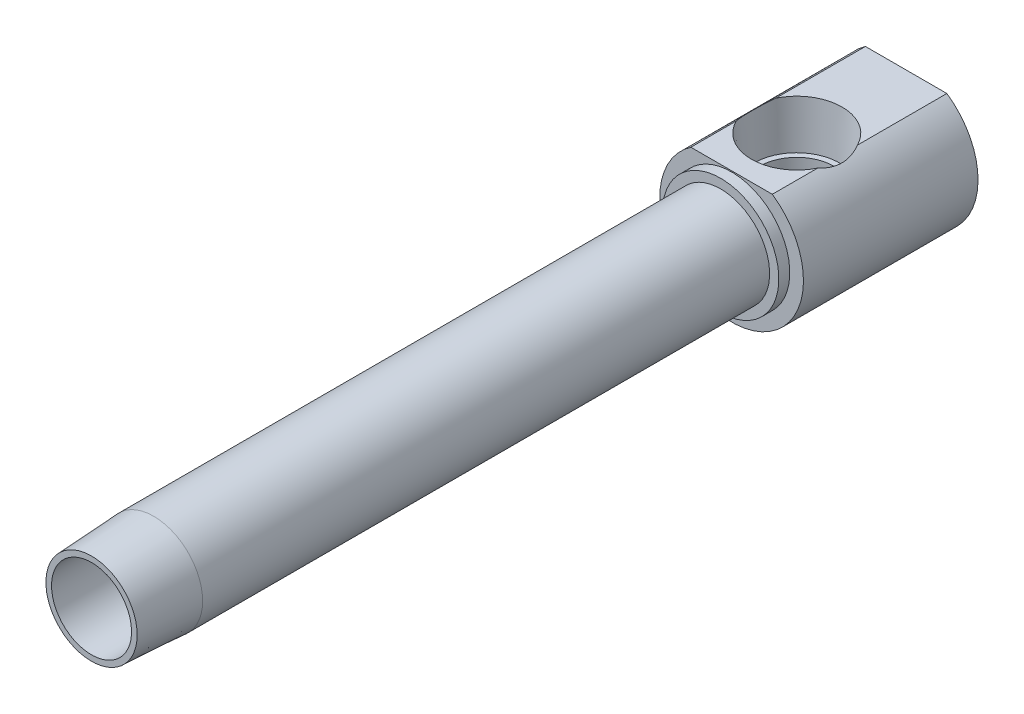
ISO-10303-21;
HEADER;
FILE_DESCRIPTION(('STEP AP214'),'2;1');
FILE_NAME('part.step','',(''),(''),'','','');
FILE_SCHEMA(('AUTOMOTIVE_DESIGN { 1 0 10303 214 1 1 1 1 }'));
ENDSEC;
DATA;
#1=APPLICATION_CONTEXT('core data for automotive mechanical design processes');
#2=APPLICATION_PROTOCOL_DEFINITION('international standard','automotive_design',2000,#1);
#3=PRODUCT_CONTEXT('',#1,'mechanical');
#4=PRODUCT('Part','Part','',(#3));
#5=PRODUCT_RELATED_PRODUCT_CATEGORY('part','',(#4));
#6=PRODUCT_DEFINITION_FORMATION('','',#4);
#7=PRODUCT_DEFINITION_CONTEXT('part definition',#1,'design');
#8=PRODUCT_DEFINITION('design','',#6,#7);
#9=PRODUCT_DEFINITION_SHAPE('','',#8);
#10=(LENGTH_UNIT() NAMED_UNIT(*) SI_UNIT(.MILLI.,.METRE.));
#11=(NAMED_UNIT(*) PLANE_ANGLE_UNIT() SI_UNIT($,.RADIAN.));
#12=(NAMED_UNIT(*) SI_UNIT($,.STERADIAN.) SOLID_ANGLE_UNIT());
#13=UNCERTAINTY_MEASURE_WITH_UNIT(LENGTH_MEASURE(1.E-05),#10,'distance_accuracy_value','');
#14=(GEOMETRIC_REPRESENTATION_CONTEXT(3) GLOBAL_UNCERTAINTY_ASSIGNED_CONTEXT((#13)) GLOBAL_UNIT_ASSIGNED_CONTEXT((#10,
#11,#12)) REPRESENTATION_CONTEXT('',''));
#15=CARTESIAN_POINT('',(0.,0.,0.));
#16=DIRECTION('',(0.,0.,1.));
#17=DIRECTION('',(1.,0.,0.));
#18=AXIS2_PLACEMENT_3D('',#15,#16,#17);
#19=CARTESIAN_POINT('',(0.,0.,-195.847166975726));
#20=DIRECTION('',(0.,0.,-1.));
#21=DIRECTION('',(-1.,0.,0.));
#22=AXIS2_PLACEMENT_3D('',#19,#20,#21);
#23=CYLINDRICAL_SURFACE('',#22,10.6883167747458);
#24=CARTESIAN_POINT('',(0.,0.,-137.3124));
#25=DIRECTION('',(0.,0.,-1.));
#26=DIRECTION('',(-1.,0.,0.));
#27=AXIS2_PLACEMENT_3D('',#24,#25,#26);
#28=CIRCLE('',#27,10.6883167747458);
#29=CARTESIAN_POINT('',(-10.6883167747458,0.,-137.3124));
#30=VERTEX_POINT('',#29);
#31=EDGE_CURVE('E143',#30,#30,#28,.T.);
#32=ORIENTED_EDGE('',*,*,#31,.F.);
#33=EDGE_LOOP('',(#32));
#34=FACE_BOUND('',#33,.T.);
#35=CARTESIAN_POINT('',(0.,0.,-13.5636));
#36=DIRECTION('',(0.,0.,1.));
#37=DIRECTION('',(1.,0.,0.));
#38=AXIS2_PLACEMENT_3D('',#35,#36,#37);
#39=CIRCLE('',#38,10.6883167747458);
#40=CARTESIAN_POINT('',(10.6883167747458,0.,-13.5636));
#41=VERTEX_POINT('',#40);
#42=EDGE_CURVE('E229',#41,#41,#39,.T.);
#43=ORIENTED_EDGE('',*,*,#42,.F.);
#44=EDGE_LOOP('',(#43));
#45=FACE_BOUND('',#44,.T.);
#46=ADVANCED_FACE('F15',(#34,#45),#23,.T.);
#47=CARTESIAN_POINT('',(-8.73125000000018,0.,0.));
#48=DIRECTION('',(0.,0.,1.));
#49=DIRECTION('',(1.,0.,0.));
#50=AXIS2_PLACEMENT_3D('',#47,#48,#49);
#51=PLANE('',#50);
#52=CARTESIAN_POINT('',(0.,0.,0.));
#53=DIRECTION('',(0.,0.,-1.));
#54=DIRECTION('',(-1.,0.,0.));
#55=AXIS2_PLACEMENT_3D('',#52,#53,#54);
#56=CIRCLE('',#55,8.73125000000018);
#57=CARTESIAN_POINT('',(-8.73125000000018,0.,0.));
#58=VERTEX_POINT('',#57);
#59=EDGE_CURVE('E19',#58,#58,#56,.T.);
#60=ORIENTED_EDGE('',*,*,#59,.T.);
#61=EDGE_LOOP('',(#60));
#62=FACE_BOUND('',#61,.T.);
#63=CARTESIAN_POINT('',(0.,0.,0.));
#64=DIRECTION('',(0.,0.,1.));
#65=DIRECTION('',(1.,0.,0.));
#66=AXIS2_PLACEMENT_3D('',#63,#64,#65);
#67=CIRCLE('',#66,9.9568);
#68=CARTESIAN_POINT('',(9.9568,0.,0.));
#69=VERTEX_POINT('',#68);
#70=EDGE_CURVE('E231',#69,#69,#67,.T.);
#71=ORIENTED_EDGE('',*,*,#70,.T.);
#72=EDGE_LOOP('',(#71));
#73=FACE_BOUND('',#72,.T.);
#74=ADVANCED_FACE('F17',(#62,#73),#51,.T.);
#75=CARTESIAN_POINT('',(-8.89,12.9217429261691,-120.65));
#76=DIRECTION('',(0.,-1.,0.));
#77=DIRECTION('',(0.,0.,-1.));
#78=AXIS2_PLACEMENT_3D('',#75,#76,#77);
#79=PLANE('',#78);
#80=DIRECTION('',(0.,0.,-1.));
#81=VECTOR('',#80,1.);
#82=CARTESIAN_POINT('',(8.89,12.9217429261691,-120.65));
#83=LINE('',#82,#81);
#84=CARTESIAN_POINT('',(8.89,12.9217429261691,-139.7));
#85=VERTEX_POINT('',#84);
#86=CARTESIAN_POINT('',(8.89,12.9217429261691,-149.598054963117));
#87=VERTEX_POINT('',#86);
#88=EDGE_CURVE('E127',#85,#87,#83,.T.);
#89=ORIENTED_EDGE('',*,*,#88,.T.);
#90=CARTESIAN_POINT('',(0.,12.9217429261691,-153.924));
#91=DIRECTION('',(0.,-1.,0.));
#92=DIRECTION('',(0.,0.,-1.));
#93=AXIS2_PLACEMENT_3D('',#90,#91,#92);
#94=CIRCLE('',#93,9.88665264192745);
#95=CARTESIAN_POINT('',(-8.89,12.9217429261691,-149.598054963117));
#96=VERTEX_POINT('',#95);
#97=EDGE_CURVE('E111',#87,#96,#94,.T.);
#98=ORIENTED_EDGE('',*,*,#97,.T.);
#99=DIRECTION('',(0.,0.,-1.));
#100=VECTOR('',#99,1.);
#101=CARTESIAN_POINT('',(-8.89,12.9217429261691,-120.65));
#102=LINE('',#101,#100);
#103=CARTESIAN_POINT('',(-8.89,12.9217429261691,-139.7));
#104=VERTEX_POINT('',#103);
#105=EDGE_CURVE('E138',#104,#96,#102,.T.);
#106=ORIENTED_EDGE('',*,*,#105,.F.);
#107=DIRECTION('',(1.,0.,0.));
#108=VECTOR('',#107,1.);
#109=CARTESIAN_POINT('',(-12.7,12.9217429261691,-139.7));
#110=LINE('',#109,#108);
#111=EDGE_CURVE('E135',#104,#85,#110,.T.);
#112=ORIENTED_EDGE('',*,*,#111,.T.);
#113=EDGE_LOOP('',(#89,#98,#106,#112));
#114=FACE_BOUND('',#113,.T.);
#115=ADVANCED_FACE('F133',(#114),#79,.F.);
#116=CARTESIAN_POINT('',(-8.73125000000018,0.,-137.727796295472));
#117=DIRECTION('',(0.,0.,1.));
#118=DIRECTION('',(1.,0.,0.));
#119=AXIS2_PLACEMENT_3D('',#116,#117,#118);
#120=PLANE('',#119);
#121=CARTESIAN_POINT('',(0.,0.,-137.727796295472));
#122=DIRECTION('',(0.,0.,-1.));
#123=DIRECTION('',(-1.,0.,0.));
#124=AXIS2_PLACEMENT_3D('',#121,#122,#123);
#125=CIRCLE('',#124,8.73125000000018);
#126=CARTESIAN_POINT('',(-8.73125000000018,0.,-137.727796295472));
#127=VERTEX_POINT('',#126);
#128=EDGE_CURVE('E157',#127,#127,#125,.T.);
#129=ORIENTED_EDGE('',*,*,#128,.F.);
#130=EDGE_LOOP('',(#129));
#131=FACE_BOUND('',#130,.T.);
#132=CARTESIAN_POINT('',(0.,-1.53831558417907,-137.727796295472));
#133=DIRECTION('',(0.,0.,1.));
#134=DIRECTION('',(0.,1.,0.));
#135=AXIS2_PLACEMENT_3D('',#132,#133,#134);
#136=ELLIPSE('',#135,7.0682508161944,6.80767250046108);
#137=CARTESIAN_POINT('',(0.,5.52993523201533,-137.727796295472));
#138=VERTEX_POINT('',#137);
#139=EDGE_CURVE('E162',#138,#138,#136,.F.);
#140=ORIENTED_EDGE('',*,*,#139,.T.);
#141=EDGE_LOOP('',(#140));
#142=FACE_BOUND('',#141,.T.);
#143=ADVANCED_FACE('F211',(#131,#142),#120,.T.);
#144=CARTESIAN_POINT('',(0.,0.,-195.847166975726));
#145=DIRECTION('',(0.,0.,-1.));
#146=DIRECTION('',(-1.,0.,0.));
#147=AXIS2_PLACEMENT_3D('',#144,#145,#146);
#148=CYLINDRICAL_SURFACE('',#147,8.73125000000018);
#149=ORIENTED_EDGE('',*,*,#128,.T.);
#150=EDGE_LOOP('',(#149));
#151=FACE_BOUND('',#150,.T.);
#152=ORIENTED_EDGE('',*,*,#59,.F.);
#153=EDGE_LOOP('',(#152));
#154=FACE_BOUND('',#153,.T.);
#155=ADVANCED_FACE('F209',(#151,#154),#148,.F.);
#156=CARTESIAN_POINT('',(-15.6845,0.,-177.8));
#157=DIRECTION('',(0.,0.,-1.));
#158=DIRECTION('',(-1.,0.,0.));
#159=AXIS2_PLACEMENT_3D('',#156,#157,#158);
#160=PLANE('',#159);
#161=DIRECTION('',(1.,0.,0.));
#162=VECTOR('',#161,1.);
#163=CARTESIAN_POINT('',(-3.66617420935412,6.35,-177.8));
#164=LINE('',#163,#162);
#165=CARTESIAN_POINT('',(-3.66617420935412,6.35,-177.8));
#166=VERTEX_POINT('',#165);
#167=CARTESIAN_POINT('',(3.66617420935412,6.35,-177.8));
#168=VERTEX_POINT('',#167);
#169=EDGE_CURVE('E165',#166,#168,#164,.T.);
#170=ORIENTED_EDGE('',*,*,#169,.F.);
#171=DIRECTION('',(0.5,0.866025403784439,0.));
#172=VECTOR('',#171,1.);
#173=CARTESIAN_POINT('',(-7.33234841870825,0.,-177.8));
#174=LINE('',#173,#172);
#175=CARTESIAN_POINT('',(-7.33234841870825,0.,-177.8));
#176=VERTEX_POINT('',#175);
#177=EDGE_CURVE('E284',#176,#166,#174,.T.);
#178=ORIENTED_EDGE('',*,*,#177,.F.);
#179=DIRECTION('',(-0.5,0.866025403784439,0.));
#180=VECTOR('',#179,1.);
#181=CARTESIAN_POINT('',(-3.66617420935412,-6.35,-177.8));
#182=LINE('',#181,#180);
#183=CARTESIAN_POINT('',(-3.66617420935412,-6.35,-177.8));
#184=VERTEX_POINT('',#183);
#185=EDGE_CURVE('E310',#184,#176,#182,.T.);
#186=ORIENTED_EDGE('',*,*,#185,.F.);
#187=DIRECTION('',(-1.,0.,0.));
#188=VECTOR('',#187,1.);
#189=CARTESIAN_POINT('',(3.66617420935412,-6.35,-177.8));
#190=LINE('',#189,#188);
#191=CARTESIAN_POINT('',(3.66617420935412,-6.35,-177.8));
#192=VERTEX_POINT('',#191);
#193=EDGE_CURVE('E307',#192,#184,#190,.T.);
#194=ORIENTED_EDGE('',*,*,#193,.F.);
#195=DIRECTION('',(-0.5,-0.866025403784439,0.));
#196=VECTOR('',#195,1.);
#197=CARTESIAN_POINT('',(7.33234841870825,0.,-177.8));
#198=LINE('',#197,#196);
#199=CARTESIAN_POINT('',(7.33234841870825,0.,-177.8));
#200=VERTEX_POINT('',#199);
#201=EDGE_CURVE('E304',#200,#192,#198,.T.);
#202=ORIENTED_EDGE('',*,*,#201,.F.);
#203=DIRECTION('',(0.5,-0.866025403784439,0.));
#204=VECTOR('',#203,1.);
#205=CARTESIAN_POINT('',(3.66617420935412,6.35,-177.8));
#206=LINE('',#205,#204);
#207=EDGE_CURVE('E301',#168,#200,#206,.T.);
#208=ORIENTED_EDGE('',*,*,#207,.F.);
#209=EDGE_LOOP('',(#170,#178,#186,#194,#202,#208));
#210=FACE_BOUND('',#209,.T.);
#211=DIRECTION('',(-1.,0.,0.));
#212=VECTOR('',#211,1.);
#213=CARTESIAN_POINT('',(-8.89,12.9217429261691,-177.8));
#214=LINE('',#213,#212);
#215=CARTESIAN_POINT('',(8.89,12.9217429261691,-177.8));
#216=VERTEX_POINT('',#215);
#217=CARTESIAN_POINT('',(-8.89,12.9217429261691,-177.8));
#218=VERTEX_POINT('',#217);
#219=EDGE_CURVE('E140',#216,#218,#214,.T.);
#220=ORIENTED_EDGE('',*,*,#219,.F.);
#221=CARTESIAN_POINT('',(0.,0.,-177.8));
#222=DIRECTION('',(0.,0.,-1.));
#223=DIRECTION('',(-1.,0.,0.));
#224=AXIS2_PLACEMENT_3D('',#221,#222,#223);
#225=CIRCLE('',#224,15.6845);
#226=EDGE_CURVE('E154',#216,#218,#225,.T.);
#227=ORIENTED_EDGE('',*,*,#226,.T.);
#228=EDGE_LOOP('',(#220,#227));
#229=FACE_BOUND('',#228,.T.);
#230=ADVANCED_FACE('F204',(#210,#229),#160,.T.);
#231=CARTESIAN_POINT('',(0.,0.,-195.847166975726));
#232=DIRECTION('',(0.,0.,-1.));
#233=DIRECTION('',(-1.,0.,0.));
#234=AXIS2_PLACEMENT_3D('',#231,#232,#233);
#235=CYLINDRICAL_SURFACE('',#234,15.6845);
#236=CARTESIAN_POINT('',(6.18126199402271,14.4151149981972,-146.107890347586));
#237=CARTESIAN_POINT('',(6.40820210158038,14.3178270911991,-146.293892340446));
#238=CARTESIAN_POINT('',(6.62617183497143,14.2179923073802,-146.489429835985));
#239=CARTESIAN_POINT('',(7.04356392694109,14.0158966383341,-146.898561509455));
#240=CARTESIAN_POINT('',(7.2429733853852,13.9136341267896,-147.112168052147));
#241=CARTESIAN_POINT('',(7.62085258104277,13.7102837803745,-147.554442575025));
#242=CARTESIAN_POINT('',(7.79947267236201,13.6091929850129,-147.782980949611));
#243=CARTESIAN_POINT('',(8.13667540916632,13.4103063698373,-148.255534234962));
#244=CARTESIAN_POINT('',(8.29527210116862,13.3125082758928,-148.499538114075));
#245=CARTESIAN_POINT('',(8.5240537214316,13.166366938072,-148.887604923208));
#246=CARTESIAN_POINT('',(8.60159506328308,13.1157948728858,-149.026544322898));
#247=CARTESIAN_POINT('',(8.75042416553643,13.0169736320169,-149.308789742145));
#248=CARTESIAN_POINT('',(8.82170394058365,12.9687274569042,-149.45210103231));
#249=CARTESIAN_POINT('',(8.98942344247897,12.85334420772,-149.810530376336));
#250=CARTESIAN_POINT('',(9.082097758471,12.7878879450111,-150.027972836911));
#251=CARTESIAN_POINT('',(9.25265845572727,12.6650269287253,-150.470791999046));
#252=CARTESIAN_POINT('',(9.3305452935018,12.6076219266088,-150.696168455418));
#253=CARTESIAN_POINT('',(9.47086217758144,12.5025600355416,-151.154136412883));
#254=CARTESIAN_POINT('',(9.53327990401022,12.4549109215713,-151.386733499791));
#255=CARTESIAN_POINT('',(9.64181076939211,12.3710847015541,-151.857621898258));
#256=CARTESIAN_POINT('',(9.68793245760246,12.3349015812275,-152.095910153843));
#257=CARTESIAN_POINT('',(9.76349281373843,12.2751820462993,-152.578204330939));
#258=CARTESIAN_POINT('',(9.7928289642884,12.2517233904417,-152.822236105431));
#259=CARTESIAN_POINT('',(9.83390591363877,12.2187780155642,-153.312731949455));
#260=CARTESIAN_POINT('',(9.84564637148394,12.2092915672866,-153.559196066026));
#261=CARTESIAN_POINT('',(9.85132494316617,12.2047101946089,-154.052460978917));
#262=CARTESIAN_POINT('',(9.84526326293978,12.2096151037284,-154.299261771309));
#263=CARTESIAN_POINT('',(9.81544491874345,12.2335989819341,-154.791077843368));
#264=CARTESIAN_POINT('',(9.79168936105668,12.2526770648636,-155.036093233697));
#265=CARTESIAN_POINT('',(9.7294701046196,12.3021291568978,-155.503007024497));
#266=CARTESIAN_POINT('',(9.69232783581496,12.3314830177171,-155.725192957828));
#267=CARTESIAN_POINT('',(9.60385268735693,12.400512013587,-156.165181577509));
#268=CARTESIAN_POINT('',(9.55251354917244,12.4401917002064,-156.382982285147));
#269=CARTESIAN_POINT('',(9.43631194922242,12.5285621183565,-156.812660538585));
#270=CARTESIAN_POINT('',(9.37147123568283,12.5772383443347,-157.024546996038));
#271=CARTESIAN_POINT('',(9.22879623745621,12.6822986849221,-157.441936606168));
#272=CARTESIAN_POINT('',(9.1509619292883,12.7386828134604,-157.647439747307));
#273=CARTESIAN_POINT('',(9.01061877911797,12.838109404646,-157.984726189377));
#274=CARTESIAN_POINT('',(8.95152353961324,12.8794177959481,-158.118466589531));
#275=CARTESIAN_POINT('',(8.76461266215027,13.0080031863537,-158.517903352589));
#276=CARTESIAN_POINT('',(8.62838014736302,13.0990466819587,-158.778521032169));
#277=CARTESIAN_POINT('',(8.33484719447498,13.2877507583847,-159.285122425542));
#278=CARTESIAN_POINT('',(8.17753852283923,13.385413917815,-159.531100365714));
#279=CARTESIAN_POINT('',(7.84238437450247,13.5844995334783,-160.0080815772));
#280=CARTESIAN_POINT('',(7.66448703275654,13.685931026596,-160.239044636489));
#281=CARTESIAN_POINT('',(7.28939666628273,13.8893391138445,-160.684214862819));
#282=CARTESIAN_POINT('',(7.09221474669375,13.9913153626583,-160.898431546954));
#283=CARTESIAN_POINT('',(6.68803601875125,14.1888008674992,-161.300395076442));
#284=CARTESIAN_POINT('',(6.48182024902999,14.2844001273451,-161.488882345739));
#285=CARTESIAN_POINT('',(6.05384699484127,14.4709681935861,-161.847789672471));
#286=CARTESIAN_POINT('',(5.83215453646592,14.5619538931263,-162.018278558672));
#287=CARTESIAN_POINT('',(5.60267382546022,14.6496957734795,-162.179590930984));
#288=B_SPLINE_CURVE_WITH_KNOTS('',3,(#236,#237,#238,#239,#240,#241,#242,#243,#244,#245,#246,
#247,#248,#249,#250,#251,#252,#253,#254,#255,#256,#257,#258,#259,#260,#261,#262,#263,#264,#265,
#266,#267,#268,#269,#270,#271,#272,#273,#274,#275,#276,#277,#278,#279,#280,#281,#282,#283,#284,
#285,#286,#287),.UNSPECIFIED.,.F.,.F.,(4,2,2,2,2,2,2,2,2,2,2,2,2,2,2,2,2,2,2,2,2,2,2,2,2,4),(0.,
0.927053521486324,1.85474664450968,2.77524763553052,3.69509925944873,4.19580328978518,
4.6971368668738,5.43222687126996,6.16729417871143,6.90294503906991,7.63820938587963,
8.37791768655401,9.11764032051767,9.85735439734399,10.5970222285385,11.2778067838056,
11.9588919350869,12.6388883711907,13.3188860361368,13.7745816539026,14.696795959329,
15.6193715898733,16.5443240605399,17.4687469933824,18.3536130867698,19.2349623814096),.UNSPECIFIED.);
#289=CARTESIAN_POINT('',(8.89,12.9217429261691,-158.249945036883));
#290=VERTEX_POINT('',#289);
#291=EDGE_CURVE('E31',#87,#290,#288,.T.);
#292=ORIENTED_EDGE('',*,*,#291,.F.);
#293=ORIENTED_EDGE('',*,*,#88,.F.);
#294=CARTESIAN_POINT('',(0.,0.,-139.7));
#295=DIRECTION('',(0.,0.,-1.));
#296=DIRECTION('',(-1.,0.,0.));
#297=AXIS2_PLACEMENT_3D('',#294,#295,#296);
#298=CIRCLE('',#297,15.6845);
#299=EDGE_CURVE('E152',#85,#104,#298,.T.);
#300=ORIENTED_EDGE('',*,*,#299,.T.);
#301=ORIENTED_EDGE('',*,*,#105,.T.);
#302=CARTESIAN_POINT('',(-5.60267382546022,14.6496957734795,-162.179590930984));
#303=CARTESIAN_POINT('',(-5.83916916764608,14.5592741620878,-162.013346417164));
#304=CARTESIAN_POINT('',(-6.06739391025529,14.4654038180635,-161.837356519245));
#305=CARTESIAN_POINT('',(-6.50657666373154,14.2732361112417,-161.467106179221));
#306=CARTESIAN_POINT('',(-6.71753229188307,14.1749381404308,-161.272843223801));
#307=CARTESIAN_POINT('',(-7.12045557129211,13.9768691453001,-160.86824748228));
#308=CARTESIAN_POINT('',(-7.31250621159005,13.8771069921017,-160.657992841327));
#309=CARTESIAN_POINT('',(-7.67797599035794,13.6782845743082,-160.221703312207));
#310=CARTESIAN_POINT('',(-7.851401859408,13.5792240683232,-159.995674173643));
#311=CARTESIAN_POINT('',(-8.18139016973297,13.3830412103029,-159.525173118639));
#312=CARTESIAN_POINT('',(-8.33766306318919,13.2859696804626,-159.280476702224));
#313=CARTESIAN_POINT('',(-8.6295458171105,13.0982677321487,-158.776292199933));
#314=CARTESIAN_POINT('',(-8.76513502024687,13.0076438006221,-158.516789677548));
#315=CARTESIAN_POINT('',(-8.98947377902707,12.8533099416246,-158.037363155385));
#316=CARTESIAN_POINT('',(-9.08217383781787,12.7878343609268,-157.819849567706));
#317=CARTESIAN_POINT('',(-9.25276992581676,12.6649454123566,-157.376898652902));
#318=CARTESIAN_POINT('',(-9.33066889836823,12.6075304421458,-157.151462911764));
#319=CARTESIAN_POINT('',(-9.47096094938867,12.5024850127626,-156.693506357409));
#320=CARTESIAN_POINT('',(-9.53335030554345,12.4548569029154,-156.46098385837));
#321=CARTESIAN_POINT('',(-9.64183755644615,12.3710636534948,-155.990239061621));
#322=CARTESIAN_POINT('',(-9.68794342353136,12.3348929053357,-155.752019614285));
#323=CARTESIAN_POINT('',(-9.76349062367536,12.2751837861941,-155.269809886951));
#324=CARTESIAN_POINT('',(-9.79282550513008,12.2517261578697,-155.025792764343));
#325=CARTESIAN_POINT('',(-9.83390185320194,12.2187812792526,-154.535328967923));
#326=CARTESIAN_POINT('',(-9.84564316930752,12.2092941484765,-154.288882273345));
#327=CARTESIAN_POINT('',(-9.85132631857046,12.2047090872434,-153.795619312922));
#328=CARTESIAN_POINT('',(-9.84526600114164,12.2096128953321,-153.548803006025));
#329=CARTESIAN_POINT('',(-9.81544809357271,12.2335964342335,-153.056954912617));
#330=CARTESIAN_POINT('',(-9.79169153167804,12.2526753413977,-152.811923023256));
#331=CARTESIAN_POINT('',(-9.72947134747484,12.3021281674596,-152.345002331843));
#332=CARTESIAN_POINT('',(-9.69233092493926,12.3314805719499,-152.122825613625));
#333=CARTESIAN_POINT('',(-9.60386128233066,12.4005053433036,-151.682857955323));
#334=CARTESIAN_POINT('',(-9.55252598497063,12.4401821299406,-151.4650689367));
#335=CARTESIAN_POINT('',(-9.43632738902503,12.5285504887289,-151.03539132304));
#336=CARTESIAN_POINT('',(-9.37148448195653,12.5772284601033,-150.823494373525));
#337=CARTESIAN_POINT('',(-9.22880457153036,12.6822926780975,-150.406085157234));
#338=CARTESIAN_POINT('',(-9.15096746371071,12.7386789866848,-150.200572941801));
#339=CARTESIAN_POINT('',(-9.01061796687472,12.8381099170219,-149.863272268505));
#340=CARTESIAN_POINT('',(-8.95152097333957,12.8794194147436,-149.729528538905));
#341=CARTESIAN_POINT('',(-8.80068775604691,12.9831855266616,-149.407189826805));
#342=CARTESIAN_POINT('',(-8.70603543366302,13.0469462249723,-149.220366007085));
#343=CARTESIAN_POINT('',(-8.50583150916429,13.1783430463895,-148.853845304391));
#344=CARTESIAN_POINT('',(-8.40026939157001,13.2459828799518,-148.674155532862));
#345=CARTESIAN_POINT('',(-8.14693598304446,13.403699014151,-148.272018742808));
#346=CARTESIAN_POINT('',(-7.99573471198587,13.4946529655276,-148.052065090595));
#347=CARTESIAN_POINT('',(-7.67663330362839,13.6786987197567,-147.625415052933));
#348=CARTESIAN_POINT('',(-7.50872479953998,13.7717915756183,-147.418725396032));
#349=CARTESIAN_POINT('',(-7.15655125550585,13.9580450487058,-147.019106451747));
#350=CARTESIAN_POINT('',(-6.97225920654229,14.0512055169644,-146.826200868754));
#351=CARTESIAN_POINT('',(-6.58822039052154,14.2353204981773,-146.455512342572));
#352=CARTESIAN_POINT('',(-6.38848080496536,14.3262760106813,-146.277722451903));
#353=CARTESIAN_POINT('',(-6.18126199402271,14.4151149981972,-146.107890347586));
#354=B_SPLINE_CURVE_WITH_KNOTS('',3,(#302,#303,#304,#305,#306,#307,#308,#309,#310,#311,#312,
#313,#314,#315,#316,#317,#318,#319,#320,#321,#322,#323,#324,#325,#326,#327,#328,#329,#330,#331,
#332,#333,#334,#335,#336,#337,#338,#339,#340,#341,#342,#343,#344,#345,#346,#347,#348,#349,#350,
#351,#352,#353),.UNSPECIFIED.,.F.,.F.,(4,2,2,2,2,2,2,2,2,2,2,2,2,2,2,2,2,2,2,2,2,2,2,2,2,4),(0.,
0.908274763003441,1.81667463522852,2.72089010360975,3.62477770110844,4.54212421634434,
5.46038099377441,6.19576092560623,6.93099446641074,7.66640429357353,8.40145356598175,
9.14111809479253,9.88078895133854,10.6205491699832,11.3602664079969,12.0410224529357,
12.7220704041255,13.4020975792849,14.0821302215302,14.5378258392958,15.1941212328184,
15.8510552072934,16.6961350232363,17.5416401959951,18.388566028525,19.2351004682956),.UNSPECIFIED.);
#355=CARTESIAN_POINT('',(-8.89,12.9217429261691,-158.249945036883));
#356=VERTEX_POINT('',#355);
#357=EDGE_CURVE('E115',#356,#96,#354,.T.);
#358=ORIENTED_EDGE('',*,*,#357,.F.);
#359=EDGE_CURVE('E136',#356,#218,#102,.T.);
#360=ORIENTED_EDGE('',*,*,#359,.T.);
#361=ORIENTED_EDGE('',*,*,#226,.F.);
#362=EDGE_CURVE('E130',#290,#216,#83,.T.);
#363=ORIENTED_EDGE('',*,*,#362,.F.);
#364=EDGE_LOOP('',(#292,#293,#300,#301,#358,#360,#361,#363));
#365=FACE_BOUND('',#364,.T.);
#366=ADVANCED_FACE('F125',(#365),#235,.T.);
#367=CARTESIAN_POINT('',(-12.7,0.,-139.7));
#368=DIRECTION('',(0.,0.,1.));
#369=DIRECTION('',(1.,0.,0.));
#370=AXIS2_PLACEMENT_3D('',#367,#368,#369);
#371=PLANE('',#370);
#372=ORIENTED_EDGE('',*,*,#111,.F.);
#373=ORIENTED_EDGE('',*,*,#299,.F.);
#374=EDGE_LOOP('',(#372,#373));
#375=FACE_BOUND('',#374,.T.);
#376=CARTESIAN_POINT('',(0.,0.,-139.7));
#377=DIRECTION('',(0.,0.,-1.));
#378=DIRECTION('',(-1.,0.,0.));
#379=AXIS2_PLACEMENT_3D('',#376,#377,#378);
#380=CIRCLE('',#379,12.7);
#381=CARTESIAN_POINT('',(-12.7,0.,-139.7));
#382=VERTEX_POINT('',#381);
#383=EDGE_CURVE('E149',#382,#382,#380,.T.);
#384=ORIENTED_EDGE('',*,*,#383,.T.);
#385=EDGE_LOOP('',(#384));
#386=FACE_BOUND('',#385,.T.);
#387=ADVANCED_FACE('F203',(#375,#386),#371,.T.);
#388=CARTESIAN_POINT('',(0.,0.,-195.847166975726));
#389=DIRECTION('',(0.,0.,-1.));
#390=DIRECTION('',(-1.,0.,0.));
#391=AXIS2_PLACEMENT_3D('',#388,#389,#390);
#392=CYLINDRICAL_SURFACE('',#391,12.7);
#393=CARTESIAN_POINT('',(0.,0.,-137.3124));
#394=DIRECTION('',(0.,0.,-1.));
#395=DIRECTION('',(-1.,0.,0.));
#396=AXIS2_PLACEMENT_3D('',#393,#394,#395);
#397=CIRCLE('',#396,12.7);
#398=CARTESIAN_POINT('',(-12.7,0.,-137.3124));
#399=VERTEX_POINT('',#398);
#400=EDGE_CURVE('E146',#399,#399,#397,.T.);
#401=ORIENTED_EDGE('',*,*,#400,.T.);
#402=EDGE_LOOP('',(#401));
#403=FACE_BOUND('',#402,.T.);
#404=ORIENTED_EDGE('',*,*,#383,.F.);
#405=EDGE_LOOP('',(#404));
#406=FACE_BOUND('',#405,.T.);
#407=ADVANCED_FACE('F335',(#403,#406),#392,.T.);
#408=CARTESIAN_POINT('',(-10.6883167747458,0.,-137.3124));
#409=DIRECTION('',(0.,0.,1.));
#410=DIRECTION('',(1.,0.,0.));
#411=AXIS2_PLACEMENT_3D('',#408,#409,#410);
#412=PLANE('',#411);
#413=ORIENTED_EDGE('',*,*,#31,.T.);
#414=EDGE_LOOP('',(#413));
#415=FACE_BOUND('',#414,.T.);
#416=ORIENTED_EDGE('',*,*,#400,.F.);
#417=EDGE_LOOP('',(#416));
#418=FACE_BOUND('',#417,.T.);
#419=ADVANCED_FACE('F339',(#415,#418),#412,.T.);
#420=ORIENTED_EDGE('',*,*,#359,.F.);
#421=EDGE_CURVE('E120',#356,#290,#94,.T.);
#422=ORIENTED_EDGE('',*,*,#421,.T.);
#423=ORIENTED_EDGE('',*,*,#362,.T.);
#424=ORIENTED_EDGE('',*,*,#219,.T.);
#425=EDGE_LOOP('',(#420,#422,#423,#424));
#426=FACE_BOUND('',#425,.T.);
#427=ADVANCED_FACE('F330',(#426),#79,.F.);
#428=CARTESIAN_POINT('',(-3.66617420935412,6.35,-171.45));
#429=DIRECTION('',(0.,1.,0.));
#430=DIRECTION('',(-1.,0.,0.));
#431=AXIS2_PLACEMENT_3D('',#428,#429,#430);
#432=PLANE('',#431);
#433=ORIENTED_EDGE('',*,*,#169,.T.);
#434=DIRECTION('',(0.,0.,-1.));
#435=VECTOR('',#434,1.);
#436=CARTESIAN_POINT('',(3.66617420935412,6.35,-171.45));
#437=LINE('',#436,#435);
#438=CARTESIAN_POINT('',(3.66617420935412,6.35,-171.45));
#439=VERTEX_POINT('',#438);
#440=EDGE_CURVE('E299',#439,#168,#437,.T.);
#441=ORIENTED_EDGE('',*,*,#440,.F.);
#442=DIRECTION('',(1.,0.,0.));
#443=VECTOR('',#442,1.);
#444=CARTESIAN_POINT('',(-3.66617420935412,6.35,-171.45));
#445=LINE('',#444,#443);
#446=CARTESIAN_POINT('',(-3.66617420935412,6.35,-171.45));
#447=VERTEX_POINT('',#446);
#448=EDGE_CURVE('E280',#447,#439,#445,.T.);
#449=ORIENTED_EDGE('',*,*,#448,.F.);
#450=DIRECTION('',(0.,0.,-1.));
#451=VECTOR('',#450,1.);
#452=CARTESIAN_POINT('',(-3.66617420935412,6.35,-171.45));
#453=LINE('',#452,#451);
#454=EDGE_CURVE('E315',#447,#166,#453,.T.);
#455=ORIENTED_EDGE('',*,*,#454,.T.);
#456=EDGE_LOOP('',(#433,#441,#449,#455));
#457=FACE_BOUND('',#456,.T.);
#458=ADVANCED_FACE('F350',(#457),#432,.F.);
#459=CARTESIAN_POINT('',(-7.33234841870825,0.,-171.45));
#460=DIRECTION('',(-0.866025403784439,0.5,0.));
#461=DIRECTION('',(-0.5,-0.866025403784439,0.));
#462=AXIS2_PLACEMENT_3D('',#459,#460,#461);
#463=PLANE('',#462);
#464=ORIENTED_EDGE('',*,*,#177,.T.);
#465=ORIENTED_EDGE('',*,*,#454,.F.);
#466=DIRECTION('',(0.5,0.866025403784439,0.));
#467=VECTOR('',#466,1.);
#468=CARTESIAN_POINT('',(-7.33234841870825,0.,-171.45));
#469=LINE('',#468,#467);
#470=CARTESIAN_POINT('',(-7.33234841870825,0.,-171.45));
#471=VERTEX_POINT('',#470);
#472=EDGE_CURVE('E296',#471,#447,#469,.T.);
#473=ORIENTED_EDGE('',*,*,#472,.F.);
#474=DIRECTION('',(0.,0.,-1.));
#475=VECTOR('',#474,1.);
#476=CARTESIAN_POINT('',(-7.33234841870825,0.,-171.45));
#477=LINE('',#476,#475);
#478=EDGE_CURVE('E317',#471,#176,#477,.T.);
#479=ORIENTED_EDGE('',*,*,#478,.T.);
#480=EDGE_LOOP('',(#464,#465,#473,#479));
#481=FACE_BOUND('',#480,.T.);
#482=ADVANCED_FACE('F353',(#481),#463,.F.);
#483=CARTESIAN_POINT('',(-3.66617420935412,-6.35,-171.45));
#484=DIRECTION('',(-0.866025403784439,-0.5,0.));
#485=DIRECTION('',(0.5,-0.866025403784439,0.));
#486=AXIS2_PLACEMENT_3D('',#483,#484,#485);
#487=PLANE('',#486);
#488=ORIENTED_EDGE('',*,*,#185,.T.);
#489=ORIENTED_EDGE('',*,*,#478,.F.);
#490=DIRECTION('',(-0.5,0.866025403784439,0.));
#491=VECTOR('',#490,1.);
#492=CARTESIAN_POINT('',(-3.66617420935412,-6.35,-171.45));
#493=LINE('',#492,#491);
#494=CARTESIAN_POINT('',(-3.66617420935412,-6.35,-171.45));
#495=VERTEX_POINT('',#494);
#496=EDGE_CURVE('E293',#495,#471,#493,.T.);
#497=ORIENTED_EDGE('',*,*,#496,.F.);
#498=DIRECTION('',(0.,0.,-1.));
#499=VECTOR('',#498,1.);
#500=CARTESIAN_POINT('',(-3.66617420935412,-6.35,-171.45));
#501=LINE('',#500,#499);
#502=EDGE_CURVE('E319',#495,#184,#501,.T.);
#503=ORIENTED_EDGE('',*,*,#502,.T.);
#504=EDGE_LOOP('',(#488,#489,#497,#503));
#505=FACE_BOUND('',#504,.T.);
#506=ADVANCED_FACE('F367',(#505),#487,.F.);
#507=CARTESIAN_POINT('',(3.66617420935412,-6.35,-171.45));
#508=DIRECTION('',(0.,-1.,0.));
#509=DIRECTION('',(1.,0.,0.));
#510=AXIS2_PLACEMENT_3D('',#507,#508,#509);
#511=PLANE('',#510);
#512=ORIENTED_EDGE('',*,*,#193,.T.);
#513=ORIENTED_EDGE('',*,*,#502,.F.);
#514=DIRECTION('',(-1.,0.,0.));
#515=VECTOR('',#514,1.);
#516=CARTESIAN_POINT('',(3.66617420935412,-6.35,-171.45));
#517=LINE('',#516,#515);
#518=CARTESIAN_POINT('',(3.66617420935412,-6.35,-171.45));
#519=VERTEX_POINT('',#518);
#520=EDGE_CURVE('E290',#519,#495,#517,.T.);
#521=ORIENTED_EDGE('',*,*,#520,.F.);
#522=DIRECTION('',(0.,0.,-1.));
#523=VECTOR('',#522,1.);
#524=CARTESIAN_POINT('',(3.66617420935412,-6.35,-171.45));
#525=LINE('',#524,#523);
#526=EDGE_CURVE('E321',#519,#192,#525,.T.);
#527=ORIENTED_EDGE('',*,*,#526,.T.);
#528=EDGE_LOOP('',(#512,#513,#521,#527));
#529=FACE_BOUND('',#528,.T.);
#530=ADVANCED_FACE('F363',(#529),#511,.F.);
#531=CARTESIAN_POINT('',(7.33234841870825,0.,-171.45));
#532=DIRECTION('',(0.866025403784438,-0.5,0.));
#533=DIRECTION('',(0.5,0.866025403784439,0.));
#534=AXIS2_PLACEMENT_3D('',#531,#532,#533);
#535=PLANE('',#534);
#536=ORIENTED_EDGE('',*,*,#201,.T.);
#537=ORIENTED_EDGE('',*,*,#526,.F.);
#538=DIRECTION('',(-0.5,-0.866025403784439,0.));
#539=VECTOR('',#538,1.);
#540=CARTESIAN_POINT('',(7.33234841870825,0.,-171.45));
#541=LINE('',#540,#539);
#542=CARTESIAN_POINT('',(7.33234841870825,0.,-171.45));
#543=VERTEX_POINT('',#542);
#544=EDGE_CURVE('E287',#543,#519,#541,.T.);
#545=ORIENTED_EDGE('',*,*,#544,.F.);
#546=DIRECTION('',(0.,0.,-1.));
#547=VECTOR('',#546,1.);
#548=CARTESIAN_POINT('',(7.33234841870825,0.,-171.45));
#549=LINE('',#548,#547);
#550=EDGE_CURVE('E323',#543,#200,#549,.T.);
#551=ORIENTED_EDGE('',*,*,#550,.T.);
#552=EDGE_LOOP('',(#536,#537,#545,#551));
#553=FACE_BOUND('',#552,.T.);
#554=ADVANCED_FACE('F359',(#553),#535,.F.);
#555=CARTESIAN_POINT('',(3.66617420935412,6.35,-171.45));
#556=DIRECTION('',(0.866025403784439,0.5,0.));
#557=DIRECTION('',(-0.5,0.866025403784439,0.));
#558=AXIS2_PLACEMENT_3D('',#555,#556,#557);
#559=PLANE('',#558);
#560=ORIENTED_EDGE('',*,*,#207,.T.);
#561=ORIENTED_EDGE('',*,*,#550,.F.);
#562=DIRECTION('',(0.5,-0.866025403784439,0.));
#563=VECTOR('',#562,1.);
#564=CARTESIAN_POINT('',(3.66617420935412,6.35,-171.45));
#565=LINE('',#564,#563);
#566=EDGE_CURVE('E283',#439,#543,#565,.T.);
#567=ORIENTED_EDGE('',*,*,#566,.F.);
#568=ORIENTED_EDGE('',*,*,#440,.T.);
#569=EDGE_LOOP('',(#560,#561,#567,#568));
#570=FACE_BOUND('',#569,.T.);
#571=ADVANCED_FACE('F355',(#570),#559,.F.);
#572=CARTESIAN_POINT('',(0.,0.,-171.45));
#573=DIRECTION('',(0.,0.,-1.));
#574=DIRECTION('',(-1.,0.,0.));
#575=AXIS2_PLACEMENT_3D('',#572,#573,#574);
#576=PLANE('',#575);
#577=ORIENTED_EDGE('',*,*,#448,.T.);
#578=ORIENTED_EDGE('',*,*,#566,.T.);
#579=ORIENTED_EDGE('',*,*,#544,.T.);
#580=ORIENTED_EDGE('',*,*,#520,.T.);
#581=ORIENTED_EDGE('',*,*,#496,.T.);
#582=ORIENTED_EDGE('',*,*,#472,.T.);
#583=EDGE_LOOP('',(#577,#578,#579,#580,#581,#582));
#584=FACE_BOUND('',#583,.T.);
#585=ADVANCED_FACE('F358',(#584),#576,.T.);
#586=CARTESIAN_POINT('',(0.,-6.16022605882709,-153.584880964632));
#587=DIRECTION('',(0.,0.267292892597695,0.963615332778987));
#588=DIRECTION('',(0.,-0.963615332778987,0.267292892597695));
#589=AXIS2_PLACEMENT_3D('',#586,#587,#588);
#590=CONICAL_SURFACE('',#589,4.92936747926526,0.794181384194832);
#591=CARTESIAN_POINT('',(-4.92956747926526,-6.70529941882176,-153.399424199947));
#592=CARTESIAN_POINT('',(-4.86454849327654,-6.74578087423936,-153.451070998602));
#593=CARTESIAN_POINT('',(-4.79934438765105,-6.78602416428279,-153.502671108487));
#594=CARTESIAN_POINT('',(-4.66853190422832,-6.86595614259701,-153.605790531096));
#595=CARTESIAN_POINT('',(-4.60292352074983,-6.90564482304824,-153.657309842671));
#596=CARTESIAN_POINT('',(-4.40534693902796,-7.02381768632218,-153.811838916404));
#597=CARTESIAN_POINT('',(-4.2727227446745,-7.10134897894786,-153.91474396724));
#598=CARTESIAN_POINT('',(-4.00251092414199,-7.25460162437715,-154.122758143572));
#599=CARTESIAN_POINT('',(-3.86487828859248,-7.33024565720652,-154.227865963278));
#600=CARTESIAN_POINT('',(-3.58724919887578,-7.4763106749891,-154.438527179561));
#601=CARTESIAN_POINT('',(-3.44725356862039,-7.54673343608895,-154.544080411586));
#602=CARTESIAN_POINT('',(-3.21819876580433,-7.6544961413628,-154.716695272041));
#603=CARTESIAN_POINT('',(-3.1298916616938,-7.69427803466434,-154.783222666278));
#604=CARTESIAN_POINT('',(-2.95246158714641,-7.76968051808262,-154.917521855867));
#605=CARTESIAN_POINT('',(-2.86333881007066,-7.80530206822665,-154.985293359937));
#606=CARTESIAN_POINT('',(-2.68510954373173,-7.87069033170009,-155.122592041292));
#607=CARTESIAN_POINT('',(-2.59600565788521,-7.90048815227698,-155.192107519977));
#608=CARTESIAN_POINT('',(-2.41819352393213,-7.95229207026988,-155.334504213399));
#609=CARTESIAN_POINT('',(-2.32948506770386,-7.97430290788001,-155.407383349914));
#610=CARTESIAN_POINT('',(-2.18125639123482,-8.00258021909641,-155.534777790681));
#611=CARTESIAN_POINT('',(-2.1211797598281,-8.01160947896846,-155.58801645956));
#612=CARTESIAN_POINT('',(-2.002934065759,-8.02367996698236,-155.697228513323));
#613=CARTESIAN_POINT('',(-1.94476433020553,-8.02672333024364,-155.753200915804));
#614=CARTESIAN_POINT('',(-1.83159633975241,-8.02621720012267,-155.867693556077));
#615=CARTESIAN_POINT('',(-1.77658330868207,-8.0227015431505,-155.926199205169));
#616=CARTESIAN_POINT('',(-1.67018669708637,-8.009162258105,-156.045693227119));
#617=CARTESIAN_POINT('',(-1.61880314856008,-7.99913857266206,-156.106681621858));
#618=CARTESIAN_POINT('',(-1.50977573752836,-7.97060670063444,-156.243214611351));
#619=CARTESIAN_POINT('',(-1.4530097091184,-7.95077990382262,-156.319178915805));
#620=CARTESIAN_POINT('',(-1.34440201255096,-7.9045561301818,-156.472638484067));
#621=CARTESIAN_POINT('',(-1.29256550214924,-7.87815237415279,-156.550135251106));
#622=CARTESIAN_POINT('',(-1.19160520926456,-7.82024221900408,-156.706916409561));
#623=CARTESIAN_POINT('',(-1.14254008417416,-7.78865902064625,-156.786209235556));
#624=CARTESIAN_POINT('',(-1.0463799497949,-7.72237338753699,-156.94448783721));
#625=CARTESIAN_POINT('',(-0.999282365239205,-7.6876752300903,-157.023473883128));
#626=CARTESIAN_POINT('',(-0.905327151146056,-7.61651127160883,-157.180296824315));
#627=CARTESIAN_POINT('',(-0.858469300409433,-7.58005286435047,-157.258136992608));
#628=CARTESIAN_POINT('',(-0.762530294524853,-7.50612620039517,-157.412550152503));
#629=CARTESIAN_POINT('',(-0.713440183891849,-7.46865417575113,-157.489115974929));
#630=CARTESIAN_POINT('',(-0.636553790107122,-7.41316517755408,-157.60077536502));
#631=CARTESIAN_POINT('',(-0.610675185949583,-7.39497859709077,-157.63709331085));
#632=CARTESIAN_POINT('',(-0.557166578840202,-7.35895068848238,-157.708583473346));
#633=CARTESIAN_POINT('',(-0.52953736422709,-7.34110920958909,-157.743756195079));
#634=CARTESIAN_POINT('',(-0.472002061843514,-7.30624531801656,-157.812124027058));
#635=CARTESIAN_POINT('',(-0.442114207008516,-7.2892178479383,-157.845331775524));
#636=CARTESIAN_POINT('',(-0.378876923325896,-7.25646188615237,-157.908938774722));
#637=CARTESIAN_POINT('',(-0.345537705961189,-7.24072979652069,-157.939345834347));
#638=CARTESIAN_POINT('',(-0.298590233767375,-7.22174464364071,-157.975920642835));
#639=CARTESIAN_POINT('',(-0.287212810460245,-7.21736140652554,-157.984355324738));
#640=CARTESIAN_POINT('',(-0.263920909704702,-7.20889912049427,-158.000623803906));
#641=CARTESIAN_POINT('',(-0.252006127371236,-7.20482024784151,-158.008457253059));
#642=CARTESIAN_POINT('',(-0.215431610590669,-7.19316114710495,-158.030829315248));
#643=CARTESIAN_POINT('',(-0.189883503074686,-7.1861339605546,-158.044286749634));
#644=CARTESIAN_POINT('',(-0.143911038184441,-7.17602735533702,-158.063620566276));
#645=CARTESIAN_POINT('',(-0.124064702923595,-7.17239348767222,-158.070564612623));
#646=CARTESIAN_POINT('',(-0.0833496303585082,-7.16666514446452,-158.081506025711));
#647=CARTESIAN_POINT('',(-0.0624819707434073,-7.16456908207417,-158.085506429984));
#648=CARTESIAN_POINT('',(-0.0201025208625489,-7.16218209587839,-158.090061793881));
#649=CARTESIAN_POINT('',(0.00141281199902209,-7.16190420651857,-158.090591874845));
#650=CARTESIAN_POINT('',(0.0441684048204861,-7.16323101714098,-158.088060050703));
#651=CARTESIAN_POINT('',(0.0654085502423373,-7.16483647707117,-158.084996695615));
#652=CARTESIAN_POINT('',(0.110198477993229,-7.17008198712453,-158.074980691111));
#653=CARTESIAN_POINT('',(0.133592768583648,-7.17399996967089,-158.067496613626));
#654=CARTESIAN_POINT('',(0.17873468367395,-7.18350548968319,-158.049316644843));
#655=CARTESIAN_POINT('',(0.200478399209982,-7.18909684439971,-158.038613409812));
#656=CARTESIAN_POINT('',(0.239862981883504,-7.20073247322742,-158.016305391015));
#657=CARTESIAN_POINT('',(0.257687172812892,-7.20664892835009,-158.004949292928));
#658=CARTESIAN_POINT('',(0.292180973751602,-7.21915234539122,-157.98091272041));
#659=CARTESIAN_POINT('',(0.308849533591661,-7.22573990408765,-157.968231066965));
#660=CARTESIAN_POINT('',(0.341213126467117,-7.23941653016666,-157.941856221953));
#661=CARTESIAN_POINT('',(0.35690564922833,-7.24650679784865,-157.92816060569));
#662=CARTESIAN_POINT('',(0.387415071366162,-7.2610426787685,-157.900028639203));
#663=CARTESIAN_POINT('',(0.402232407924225,-7.26848811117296,-157.885592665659));
#664=CARTESIAN_POINT('',(0.445150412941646,-7.29098927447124,-157.841872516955));
#665=CARTESIAN_POINT('',(0.47220450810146,-7.306426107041,-157.811759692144));
#666=CARTESIAN_POINT('',(0.52428844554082,-7.33787585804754,-157.750105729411));
#667=CARTESIAN_POINT('',(0.549316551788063,-7.35388925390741,-157.718563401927));
#668=CARTESIAN_POINT('',(0.597944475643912,-7.38626125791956,-157.654432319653));
#669=CARTESIAN_POINT('',(0.621540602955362,-7.4026206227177,-157.621841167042));
#670=CARTESIAN_POINT('',(0.667647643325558,-7.43546985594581,-157.555961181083));
#671=CARTESIAN_POINT('',(0.690158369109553,-7.45195974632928,-157.522672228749));
#672=CARTESIAN_POINT('',(0.756929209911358,-7.50170827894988,-157.42146531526));
#673=CARTESIAN_POINT('',(0.800015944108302,-7.53495851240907,-157.352773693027));
#674=CARTESIAN_POINT('',(0.884912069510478,-7.60055008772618,-157.214354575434));
#675=CARTESIAN_POINT('',(0.926723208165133,-7.63289266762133,-157.144628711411));
#676=CARTESIAN_POINT('',(1.01820852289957,-7.7017110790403,-156.991803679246));
#677=CARTESIAN_POINT('',(1.06792659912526,-7.73786554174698,-156.90858379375));
#678=CARTESIAN_POINT('',(1.16983424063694,-7.80643496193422,-156.741991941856));
#679=CARTESIAN_POINT('',(1.22202530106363,-7.83884761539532,-156.658619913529));
#680=CARTESIAN_POINT('',(1.33001687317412,-7.89746710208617,-156.493949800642));
#681=CARTESIAN_POINT('',(1.38574898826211,-7.92376225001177,-156.412639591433));
#682=CARTESIAN_POINT('',(1.50302343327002,-7.96843195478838,-156.252064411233));
#683=CARTESIAN_POINT('',(1.56455968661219,-7.98681468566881,-156.172797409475));
#684=CARTESIAN_POINT('',(1.68274005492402,-8.01133052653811,-156.031030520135));
#685=CARTESIAN_POINT('',(1.7384071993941,-8.01902598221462,-155.967990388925));
#686=CARTESIAN_POINT('',(1.85342088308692,-8.0271237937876,-155.844869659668));
#687=CARTESIAN_POINT('',(1.91276752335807,-8.02752594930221,-155.784789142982));
#688=CARTESIAN_POINT('',(2.03541341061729,-8.02131936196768,-155.666443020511));
#689=CARTESIAN_POINT('',(2.09877111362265,-8.01455501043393,-155.608247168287));
#690=CARTESIAN_POINT('',(2.22705927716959,-7.99476920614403,-155.494760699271));
#691=CARTESIAN_POINT('',(2.29199008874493,-7.98174634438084,-155.439470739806));
#692=CARTESIAN_POINT('',(2.47290620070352,-7.93863392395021,-155.289375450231));
#693=CARTESIAN_POINT('',(2.58960314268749,-7.90313058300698,-155.197020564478));
#694=CARTESIAN_POINT('',(2.82250773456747,-7.82171920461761,-155.016273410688));
#695=CARTESIAN_POINT('',(2.93871435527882,-7.77579524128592,-154.927887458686));
#696=CARTESIAN_POINT('',(3.17037156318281,-7.67676905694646,-154.752626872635));
#697=CARTESIAN_POINT('',(3.28581352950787,-7.6236257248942,-154.665764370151));
#698=CARTESIAN_POINT('',(3.51496782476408,-7.51258701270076,-154.493015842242));
#699=CARTESIAN_POINT('',(3.6286812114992,-7.45469468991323,-154.407129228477));
#700=CARTESIAN_POINT('',(3.84346248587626,-7.34132392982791,-154.244073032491));
#701=CARTESIAN_POINT('',(3.94467760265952,-7.28616486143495,-154.166873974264));
#702=CARTESIAN_POINT('',(4.14594860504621,-7.17370528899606,-154.012484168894));
#703=CARTESIAN_POINT('',(4.24600427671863,-7.11640439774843,-153.93529342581));
#704=CARTESIAN_POINT('',(4.44384293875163,-7.00085162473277,-153.781745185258));
#705=CARTESIAN_POINT('',(4.54163876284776,-6.94261988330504,-153.705389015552));
#706=CARTESIAN_POINT('',(4.73628082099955,-6.82485933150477,-153.552533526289));
#707=CARTESIAN_POINT('',(4.83312730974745,-6.76533088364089,-153.476034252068));
#708=CARTESIAN_POINT('',(4.92956747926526,-6.70529941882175,-153.399424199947));
#709=B_SPLINE_CURVE_WITH_KNOTS('',3,(#591,#592,#593,#594,#595,#596,#597,#598,#599,#600,#601,
#602,#603,#604,#605,#606,#607,#608,#609,#610,#611,#612,#613,#614,#615,#616,#617,#618,#619,#620,
#621,#622,#623,#624,#625,#626,#627,#628,#629,#630,#631,#632,#633,#634,#635,#636,#637,#638,#639,
#640,#641,#642,#643,#644,#645,#646,#647,#648,#649,#650,#651,#652,#653,#654,#655,#656,#657,#658,
#659,#660,#661,#662,#663,#664,#665,#666,#667,#668,#669,#670,#671,#672,#673,#674,#675,#676,#677,
#678,#679,#680,#681,#682,#683,#684,#685,#686,#687,#688,#689,#690,#691,#692,#693,#694,#695,#696,
#697,#698,#699,#700,#701,#702,#703,#704,#705,#706,#707,#708),.UNSPECIFIED.,.F.,.F.,(4,2,2,2,2,2,
2,2,2,2,2,2,2,2,2,2,2,2,2,2,2,2,2,2,2,2,2,2,2,2,2,2,2,2,2,2,2,2,2,2,2,2,2,2,2,2,2,2,2,2,2,2,2,2,
2,2,2,2,4),(0.,0.277131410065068,0.554266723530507,1.10894454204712,1.67582273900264,
2.24250720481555,2.59495486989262,2.94732104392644,3.2977502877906,3.64796584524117,
3.89006351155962,4.13207480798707,4.37284107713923,4.61360946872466,4.90376471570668,
5.19422028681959,5.48945424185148,5.78428882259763,6.077977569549,6.37297155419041,
6.51742442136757,6.66181269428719,6.80513942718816,6.94805360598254,6.99250734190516,
7.03698662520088,7.12571030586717,7.18949790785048,7.25321959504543,7.31739760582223,
7.38160152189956,7.45580479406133,7.53017864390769,7.59592329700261,7.66172693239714,
7.72769335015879,7.79362653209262,7.92347126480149,8.05342610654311,8.18370275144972,
8.31400179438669,8.57686868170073,8.83935762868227,9.14969866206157,9.4602297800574,
9.7659529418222,10.0713595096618,10.3242750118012,10.5771974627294,10.8357264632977,
11.0943136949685,11.5525549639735,12.0115013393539,12.4731802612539,12.9345642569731,
13.350736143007,13.766983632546,14.1781512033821,14.5892052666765),.UNSPECIFIED.);
#710=CARTESIAN_POINT('',(-4.89410839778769,-6.72734191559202,-153.427571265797));
#711=VERTEX_POINT('',#710);
#712=CARTESIAN_POINT('',(4.89410839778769,-6.72734191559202,-153.427571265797));
#713=VERTEX_POINT('',#712);
#714=EDGE_CURVE('E131',#711,#713,#709,.T.);
#715=ORIENTED_EDGE('',*,*,#714,.F.);
#716=CARTESIAN_POINT('',(0.,-6.16022605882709,-153.584880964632));
#717=DIRECTION('',(0.,-0.267292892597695,-0.963615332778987));
#718=DIRECTION('',(0.,0.963615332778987,-0.267292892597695));
#719=AXIS2_PLACEMENT_3D('',#716,#717,#718);
#720=CIRCLE('',#719,4.92936747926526);
#721=EDGE_CURVE('E166',#713,#711,#720,.T.);
#722=ORIENTED_EDGE('',*,*,#721,.F.);
#723=EDGE_LOOP('',(#715,#722));
#724=FACE_BOUND('',#723,.T.);
#725=CARTESIAN_POINT('',(0.,-7.45486660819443,-158.2521785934));
#726=VERTEX_POINT('',#725);
#727=VERTEX_LOOP('',#726);
#728=FACE_BOUND('',#727,.T.);
#729=ADVANCED_FACE('F272',(#724,#728),#590,.F.);
#730=CARTESIAN_POINT('',(0.,-0.374711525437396,-132.727571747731));
#731=DIRECTION('',(0.,0.267292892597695,0.963615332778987));
#732=DIRECTION('',(0.,-0.963615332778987,0.267292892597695));
#733=AXIS2_PLACEMENT_3D('',#730,#731,#732);
#734=CONICAL_SURFACE('',#733,7.39548661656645,0.113446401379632);
#735=CARTESIAN_POINT('',(4.76098088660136,-6.76122891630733,-154.902665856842));
#736=CARTESIAN_POINT('',(4.77116683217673,-6.76832025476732,-154.792236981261));
#737=CARTESIAN_POINT('',(4.78112654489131,-6.77336535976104,-154.681648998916));
#738=CARTESIAN_POINT('',(4.8008455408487,-6.77917532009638,-154.460336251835));
#739=CARTESIAN_POINT('',(4.81060481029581,-6.77993988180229,-154.349611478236));
#740=CARTESIAN_POINT('',(4.83015809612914,-6.7770022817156,-154.128397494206));
#741=CARTESIAN_POINT('',(4.83995203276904,-6.77330720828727,-154.017908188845));
#742=CARTESIAN_POINT('',(4.85978391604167,-6.76142678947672,-153.79720343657));
#743=CARTESIAN_POINT('',(4.8698218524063,-6.75324163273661,-153.686987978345));
#744=CARTESIAN_POINT('',(4.90026789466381,-6.72230572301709,-153.359960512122));
#745=CARTESIAN_POINT('',(4.92126224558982,-6.69313187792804,-153.143782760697));
#746=CARTESIAN_POINT('',(4.96531856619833,-6.61929257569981,-152.714347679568));
#747=CARTESIAN_POINT('',(4.988380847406,-6.57462478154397,-152.501090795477));
#748=CARTESIAN_POINT('',(5.03316421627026,-6.47936742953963,-152.106225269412));
#749=CARTESIAN_POINT('',(5.05465210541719,-6.43036904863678,-151.924198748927));
#750=CARTESIAN_POINT('',(5.09871537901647,-6.32458689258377,-151.562537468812));
#751=CARTESIAN_POINT('',(5.12129098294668,-6.26780154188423,-151.3829032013));
#752=CARTESIAN_POINT('',(5.16720363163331,-6.14793098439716,-151.025522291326));
#753=CARTESIAN_POINT('',(5.19054190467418,-6.08483524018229,-150.847779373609));
#754=CARTESIAN_POINT('',(5.23760452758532,-5.9537247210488,-150.4941948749));
#755=CARTESIAN_POINT('',(5.26132885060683,-5.88571028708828,-150.318353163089));
#756=CARTESIAN_POINT('',(5.30951176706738,-5.74392399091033,-149.963611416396));
#757=CARTESIAN_POINT('',(5.33397315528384,-5.67004730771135,-149.784753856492));
#758=CARTESIAN_POINT('',(5.38276331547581,-5.51902669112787,-149.428400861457));
#759=CARTESIAN_POINT('',(5.40709208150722,-5.44188261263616,-149.250905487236));
#760=CARTESIAN_POINT('',(5.45531585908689,-5.28534639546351,-148.897843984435));
#761=CARTESIAN_POINT('',(5.47921234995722,-5.2059662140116,-148.722272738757));
#762=CARTESIAN_POINT('',(5.5265505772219,-5.04510152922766,-148.372066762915));
#763=CARTESIAN_POINT('',(5.54999238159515,-4.96361734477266,-148.197431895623));
#764=CARTESIAN_POINT('',(5.57314297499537,-4.88130922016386,-148.023154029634));
#765=B_SPLINE_CURVE_WITH_KNOTS('',3,(#735,#736,#737,#738,#739,#740,#741,#742,#743,#744,#745,
#746,#747,#748,#749,#750,#751,#752,#753,#754,#755,#756,#757,#758,#759,#760,#761,#762,#763,#764),
.UNSPECIFIED.,.F.,.F.,(4,2,2,2,2,2,2,2,2,2,2,2,2,2,4),(0.,0.333363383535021,0.666749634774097,
0.999606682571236,1.3324497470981,1.98917542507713,2.64600020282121,3.21497186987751,
3.78405882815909,4.35411246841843,4.92412663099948,5.50924941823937,6.09439821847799,
6.67685854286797,7.25923110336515),.UNSPECIFIED.);
#766=CARTESIAN_POINT('',(5.57308671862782,-4.88150922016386,-148.023577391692));
#767=VERTEX_POINT('',#766);
#768=EDGE_CURVE('E10',#713,#767,#765,.T.);
#769=ORIENTED_EDGE('',*,*,#768,.F.);
#770=ORIENTED_EDGE('',*,*,#721,.T.);
#771=CARTESIAN_POINT('',(-5.57314297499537,-4.88130922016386,-148.023154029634));
#772=CARTESIAN_POINT('',(-5.54864798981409,-4.96839763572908,-148.207564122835));
#773=CARTESIAN_POINT('',(-5.52382511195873,-5.05456937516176,-148.392372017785));
#774=CARTESIAN_POINT('',(-5.47367787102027,-5.22453041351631,-148.763054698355));
#775=CARTESIAN_POINT('',(-5.44835341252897,-5.30831925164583,-148.948929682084));
#776=CARTESIAN_POINT('',(-5.39720632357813,-5.47344975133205,-149.323121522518));
#777=CARTESIAN_POINT('',(-5.37138156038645,-5.55477268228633,-149.511446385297));
#778=CARTESIAN_POINT('',(-5.31962582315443,-5.71359939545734,-149.889679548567));
#779=CARTESIAN_POINT('',(-5.29369485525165,-5.79110339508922,-150.079587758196));
#780=CARTESIAN_POINT('',(-5.24277644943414,-5.93906110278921,-150.455846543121));
#781=CARTESIAN_POINT('',(-5.2177833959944,-6.00965380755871,-150.642141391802));
#782=CARTESIAN_POINT('',(-5.1683339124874,-6.14495538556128,-151.016963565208));
#783=CARTESIAN_POINT('',(-5.14387753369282,-6.20966369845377,-151.205491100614));
#784=CARTESIAN_POINT('',(-5.09597650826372,-6.33139627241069,-151.584642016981));
#785=CARTESIAN_POINT('',(-5.07252951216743,-6.38843911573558,-151.775259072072));
#786=CARTESIAN_POINT('',(-5.02700982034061,-6.49303667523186,-152.159216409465));
#787=CARTESIAN_POINT('',(-5.00493671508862,-6.54059422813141,-152.352555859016));
#788=CARTESIAN_POINT('',(-4.96280295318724,-6.62342077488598,-152.738818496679));
#789=CARTESIAN_POINT('',(-4.94271568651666,-6.65887471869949,-152.931698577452));
#790=CARTESIAN_POINT('',(-4.90415121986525,-6.71669386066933,-153.319648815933));
#791=CARTESIAN_POINT('',(-4.88567425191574,-6.73905717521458,-153.514719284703));
#792=CARTESIAN_POINT('',(-4.85867174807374,-6.76210080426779,-153.809451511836));
#793=CARTESIAN_POINT('',(-4.84973521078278,-6.76803526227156,-153.908688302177));
#794=CARTESIAN_POINT('',(-4.83201463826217,-6.77627351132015,-154.107333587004));
#795=CARTESIAN_POINT('',(-4.82323060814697,-6.77857718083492,-154.206742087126));
#796=CARTESIAN_POINT('',(-4.80565778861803,-6.77960294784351,-154.405654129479));
#797=CARTESIAN_POINT('',(-4.7968690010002,-6.7783221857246,-154.505157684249));
#798=CARTESIAN_POINT('',(-4.77910860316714,-6.7723195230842,-154.704038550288));
#799=CARTESIAN_POINT('',(-4.77013700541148,-6.76759785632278,-154.803415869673));
#800=CARTESIAN_POINT('',(-4.76098088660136,-6.76122891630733,-154.902665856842));
#801=B_SPLINE_CURVE_WITH_KNOTS('',3,(#771,#772,#773,#774,#775,#776,#777,#778,#779,#780,#781,
#782,#783,#784,#785,#786,#787,#788,#789,#790,#791,#792,#793,#794,#795,#796,#797,#798,#799,#800),
.UNSPECIFIED.,.F.,.F.,(4,2,2,2,2,2,2,2,2,2,2,2,2,2,4),(0.,0.616225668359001,1.23256969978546,
1.85279455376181,2.47298405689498,3.07525601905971,3.6775852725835,4.27842698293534,
4.87908873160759,5.47011155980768,6.06121940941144,6.36060783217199,6.66000627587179,
6.95964364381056,7.25926065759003),.UNSPECIFIED.);
#802=CARTESIAN_POINT('',(-5.57308671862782,-4.88150922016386,-148.023577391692));
#803=VERTEX_POINT('',#802);
#804=EDGE_CURVE('E24',#803,#711,#801,.T.);
#805=ORIENTED_EDGE('',*,*,#804,.F.);
#806=CARTESIAN_POINT('',(5.57307308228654,-4.88170922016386,-148.02356451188));
#807=CARTESIAN_POINT('',(5.58380220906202,-4.72471397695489,-148.033762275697));
#808=CARTESIAN_POINT('',(5.58865914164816,-4.56705989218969,-148.038341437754));
#809=CARTESIAN_POINT('',(5.58729946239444,-4.25213639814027,-148.037017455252));
#810=CARTESIAN_POINT('',(5.58110451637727,-4.09486684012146,-148.031134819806));
#811=CARTESIAN_POINT('',(5.55847097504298,-3.78347175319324,-148.009791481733));
#812=CARTESIAN_POINT('',(5.54214321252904,-3.62933060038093,-147.994434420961));
#813=CARTESIAN_POINT('',(5.50003700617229,-3.32335857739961,-147.955356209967));
#814=CARTESIAN_POINT('',(5.47425293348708,-3.17152913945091,-147.931630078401));
#815=CARTESIAN_POINT('',(5.40518682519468,-2.82774362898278,-147.869168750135));
#816=CARTESIAN_POINT('',(5.35900554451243,-2.63679719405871,-147.82807966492));
#817=CARTESIAN_POINT('',(5.25312186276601,-2.26100534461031,-147.736603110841));
#818=CARTESIAN_POINT('',(5.193416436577,-2.07616130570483,-147.686213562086));
#819=CARTESIAN_POINT('',(5.06084072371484,-1.71218123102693,-147.578172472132));
#820=CARTESIAN_POINT('',(4.98789692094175,-1.53308399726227,-147.520480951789));
#821=CARTESIAN_POINT('',(4.82949435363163,-1.1822650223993,-147.400185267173));
#822=CARTESIAN_POINT('',(4.7440366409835,-1.01054266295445,-147.337581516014));
#823=CARTESIAN_POINT('',(4.55845239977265,-0.670873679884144,-147.207755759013));
#824=CARTESIAN_POINT('',(4.45801514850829,-0.503125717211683,-147.140457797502));
#825=CARTESIAN_POINT('',(4.24399604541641,-0.176744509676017,-147.0045450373));
#826=CARTESIAN_POINT('',(4.13041222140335,-0.0181126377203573,-146.935930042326));
#827=CARTESIAN_POINT('',(3.89017340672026,0.28846081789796,-146.799404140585));
#828=CARTESIAN_POINT('',(3.76355762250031,0.436432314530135,-146.731491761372));
#829=CARTESIAN_POINT('',(3.49672100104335,0.72060298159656,-146.598055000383));
#830=CARTESIAN_POINT('',(3.35650635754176,0.856807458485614,-146.53252954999));
#831=CARTESIAN_POINT('',(3.00734741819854,1.16370601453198,-146.382217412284));
#832=CARTESIAN_POINT('',(2.79221632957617,1.32842462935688,-146.299314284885));
#833=CARTESIAN_POINT('',(2.33601195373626,1.62521199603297,-146.147438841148));
#834=CARTESIAN_POINT('',(2.094970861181,1.75732060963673,-146.07844953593));
#835=CARTESIAN_POINT('',(1.63295562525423,1.96142805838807,-145.970763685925));
#836=CARTESIAN_POINT('',(1.41558141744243,2.03983861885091,-145.928906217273));
#837=CARTESIAN_POINT('',(0.96901033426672,2.16345453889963,-145.86260436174));
#838=CARTESIAN_POINT('',(0.739822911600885,2.2086860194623,-145.838146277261));
#839=CARTESIAN_POINT('',(0.27482354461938,2.26253954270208,-145.809001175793));
#840=CARTESIAN_POINT('',(0.0389869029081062,2.27099973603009,-145.804401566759));
#841=CARTESIAN_POINT('',(-0.430497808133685,2.25010965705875,-145.815725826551));
#842=CARTESIAN_POINT('',(-0.664145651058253,2.22075551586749,-145.831651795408));
#843=CARTESIAN_POINT('',(-1.10663722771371,2.12989754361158,-145.88062144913));
#844=CARTESIAN_POINT('',(-1.3160961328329,2.07066749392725,-145.912453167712));
#845=CARTESIAN_POINT('',(-1.72260445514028,1.92521663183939,-145.989907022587));
#846=CARTESIAN_POINT('',(-1.91964828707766,1.83898377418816,-146.035535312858));
#847=CARTESIAN_POINT('',(-2.38300360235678,1.60033652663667,-146.160249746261));
#848=CARTESIAN_POINT('',(-2.64139610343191,1.43552053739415,-146.245207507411));
#849=CARTESIAN_POINT('',(-3.0039370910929,1.16114496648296,-146.382945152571));
#850=CARTESIAN_POINT('',(-3.12076165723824,1.06500084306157,-146.430651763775));
#851=CARTESIAN_POINT('',(-3.34618058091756,0.864667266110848,-146.528567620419));
#852=CARTESIAN_POINT('',(-3.45477680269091,0.760479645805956,-146.578776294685));
#853=CARTESIAN_POINT('',(-3.70119269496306,0.50648330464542,-146.699015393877));
#854=CARTESIAN_POINT('',(-3.83559032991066,0.353674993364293,-146.769718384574));
#855=CARTESIAN_POINT('',(-4.08982799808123,0.0367162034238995,-146.911952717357));
#856=CARTESIAN_POINT('',(-4.2096625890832,-0.127438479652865,-146.983484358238));
#857=CARTESIAN_POINT('',(-4.43540467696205,-0.466274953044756,-147.125522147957));
#858=CARTESIAN_POINT('',(-4.54126855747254,-0.640987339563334,-147.19602450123));
#859=CARTESIAN_POINT('',(-4.73876559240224,-0.999515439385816,-147.333638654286));
#860=CARTESIAN_POINT('',(-4.83040060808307,-1.18332995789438,-147.400750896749));
#861=CARTESIAN_POINT('',(-5.00106462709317,-1.56328059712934,-147.530615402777));
#862=CARTESIAN_POINT('',(-5.07979286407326,-1.75959317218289,-147.593248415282));
#863=CARTESIAN_POINT('',(-5.22175052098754,-2.16037424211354,-147.709818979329));
#864=CARTESIAN_POINT('',(-5.28497466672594,-2.36484548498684,-147.763753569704));
#865=CARTESIAN_POINT('',(-5.39444351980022,-2.77951823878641,-147.859388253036));
#866=CARTESIAN_POINT('',(-5.4408051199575,-2.98966901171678,-147.901172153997));
#867=CARTESIAN_POINT('',(-5.51558786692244,-3.4154122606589,-147.96957512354));
#868=CARTESIAN_POINT('',(-5.54403124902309,-3.63099764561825,-147.996212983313));
#869=CARTESIAN_POINT('',(-5.57721638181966,-4.01922503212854,-148.027447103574));
#870=CARTESIAN_POINT('',(-5.58571066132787,-4.19125609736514,-148.035524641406));
#871=CARTESIAN_POINT('',(-5.58858537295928,-4.44986380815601,-148.038255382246));
#872=CARTESIAN_POINT('',(-5.58788567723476,-4.53636586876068,-148.037588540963));
#873=CARTESIAN_POINT('',(-5.58306826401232,-4.70921745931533,-148.033021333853));
#874=CARTESIAN_POINT('',(-5.57894938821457,-4.79556692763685,-148.029119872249));
#875=CARTESIAN_POINT('',(-5.57307308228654,-4.88170922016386,-148.02356451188));
#876=B_SPLINE_CURVE_WITH_KNOTS('',3,(#806,#807,#808,#809,#810,#811,#812,#813,#814,#815,#816,
#817,#818,#819,#820,#821,#822,#823,#824,#825,#826,#827,#828,#829,#830,#831,#832,#833,#834,#835,
#836,#837,#838,#839,#840,#841,#842,#843,#844,#845,#846,#847,#848,#849,#850,#851,#852,#853,#854,
#855,#856,#857,#858,#859,#860,#861,#862,#863,#864,#865,#866,#867,#868,#869,#870,#871,#872,#873,
#874,#875),.UNSPECIFIED.,.F.,.F.,(4,2,2,2,2,2,2,2,2,2,2,2,2,2,2,2,2,2,2,2,2,2,2,2,2,2,2,2,2,2,2,
2,2,2,4),(0.,0.472711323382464,0.944496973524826,1.4112110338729,1.87820335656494,
2.47942025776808,3.08077177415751,3.68557104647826,4.29031950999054,4.91003652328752,
5.52984662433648,6.14784371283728,6.76556063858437,7.6126710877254,8.45874086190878,
9.16036218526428,9.86143054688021,10.5655815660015,11.2698046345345,11.9270793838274,
12.5846477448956,13.5331119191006,14.0087351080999,14.4842502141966,15.1296651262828,
15.7753204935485,16.4229461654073,17.0704870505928,17.731454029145,18.392645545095,
19.0491620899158,19.7048623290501,20.2212077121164,20.4806146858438,20.7401095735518),.UNSPECIFIED.);
#877=EDGE_CURVE('E253',#767,#803,#876,.T.);
#878=ORIENTED_EDGE('',*,*,#877,.F.);
#879=EDGE_LOOP('',(#769,#770,#805,#878));
#880=FACE_BOUND('',#879,.T.);
#881=CARTESIAN_POINT('',(0.,2.60934292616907,-105.947295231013));
#882=DIRECTION('',(0.,-1.,0.));
#883=DIRECTION('',(0.,0.,1.));
#884=AXIS2_PLACEMENT_3D('',#881,#882,#883);
#885=ELLIPSE('',#884,39.0080434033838,9.50641500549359);
#886=CARTESIAN_POINT('',(-1.18168220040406,2.60934292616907,-144.652800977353));
#887=VERTEX_POINT('',#886);
#888=CARTESIAN_POINT('',(1.18168220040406,2.60934292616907,-144.652800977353));
#889=VERTEX_POINT('',#888);
#890=EDGE_CURVE('E173',#887,#889,#885,.T.);
#891=ORIENTED_EDGE('',*,*,#890,.F.);
#892=CARTESIAN_POINT('',(1.98428488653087,2.31708369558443,-144.806541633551));
#893=CARTESIAN_POINT('',(1.87956701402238,2.36586844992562,-144.781125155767));
#894=CARTESIAN_POINT('',(1.77280064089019,2.41121842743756,-144.757375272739));
#895=CARTESIAN_POINT('',(1.55557788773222,2.4944864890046,-144.713601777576));
#896=CARTESIAN_POINT('',(1.44511880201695,2.53239897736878,-144.693580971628));
#897=CARTESIAN_POINT('',(1.22127583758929,2.60009438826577,-144.657730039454));
#898=CARTESIAN_POINT('',(1.10789752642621,2.62989168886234,-144.641892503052));
#899=CARTESIAN_POINT('',(0.878724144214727,2.6809222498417,-144.614714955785));
#900=CARTESIAN_POINT('',(0.762929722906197,2.70215778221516,-144.603373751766));
#901=CARTESIAN_POINT('',(0.529069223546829,2.73575870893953,-144.585408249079));
#902=CARTESIAN_POINT('',(0.410994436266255,2.74807716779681,-144.578808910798));
#903=CARTESIAN_POINT('',(0.174027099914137,2.76341445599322,-144.5705899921));
#904=CARTESIAN_POINT('',(0.0551342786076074,2.76643002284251,-144.56897215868));
#905=CARTESIAN_POINT('',(-0.182430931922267,2.76308504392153,-144.570765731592));
#906=CARTESIAN_POINT('',(-0.301103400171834,2.75672905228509,-144.574174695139));
#907=CARTESIAN_POINT('',(-0.537358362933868,2.73479502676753,-144.585921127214));
#908=CARTESIAN_POINT('',(-0.654940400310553,2.71921328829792,-144.594260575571));
#909=CARTESIAN_POINT('',(-0.982800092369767,2.66280247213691,-144.624387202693));
#910=CARTESIAN_POINT('',(-1.19094996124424,2.61174623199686,-144.651595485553));
#911=CARTESIAN_POINT('',(-1.49495613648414,2.5154286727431,-144.702541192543));
#912=CARTESIAN_POINT('',(-1.59499147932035,2.48000100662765,-144.721229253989));
#913=CARTESIAN_POINT('',(-1.79198682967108,2.40302399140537,-144.761666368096));
#914=CARTESIAN_POINT('',(-1.88894837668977,2.36147776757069,-144.783413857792));
#915=CARTESIAN_POINT('',(-1.98428488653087,2.31708369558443,-144.806541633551));
#916=B_SPLINE_CURVE_WITH_KNOTS('',3,(#892,#893,#894,#895,#896,#897,#898,#899,#900,#901,#902,
#903,#904,#905,#906,#907,#908,#909,#910,#911,#912,#913,#914,#915),.UNSPECIFIED.,.F.,.F.,(4,2,2,
2,2,2,2,2,2,2,2,4),(0.,0.354840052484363,0.709946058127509,1.06441875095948,1.41879731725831,
1.775027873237,2.13138334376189,2.48756569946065,2.84389117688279,3.48907935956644,
3.81214348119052,4.13504315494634),.UNSPECIFIED.);
#917=EDGE_CURVE('E161',#889,#887,#916,.T.);
#918=ORIENTED_EDGE('',*,*,#917,.F.);
#919=EDGE_LOOP('',(#891,#918));
#920=FACE_BOUND('',#919,.T.);
#921=ORIENTED_EDGE('',*,*,#139,.F.);
#922=EDGE_LOOP('',(#921));
#923=FACE_BOUND('',#922,.T.);
#924=ADVANCED_FACE('F175',(#880,#920,#923),#734,.F.);
#925=CARTESIAN_POINT('',(0.,-9.56745567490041,-153.924));
#926=DIRECTION('',(0.,1.,0.));
#927=DIRECTION('',(0.,0.,1.));
#928=AXIS2_PLACEMENT_3D('',#925,#926,#927);
#929=CONICAL_SURFACE('',#928,0.,1.0471975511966);
#930=ORIENTED_EDGE('',*,*,#768,.T.);
#931=CARTESIAN_POINT('',(0.,-4.88150922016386,-153.924));
#932=DIRECTION('',(0.,-1.,0.));
#933=DIRECTION('',(0.,0.,-1.));
#934=AXIS2_PLACEMENT_3D('',#931,#932,#933);
#935=CIRCLE('',#934,8.116297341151);
#936=EDGE_CURVE('E38',#803,#767,#935,.T.);
#937=ORIENTED_EDGE('',*,*,#936,.F.);
#938=ORIENTED_EDGE('',*,*,#804,.T.);
#939=ORIENTED_EDGE('',*,*,#714,.T.);
#940=EDGE_LOOP('',(#930,#937,#938,#939));
#941=FACE_BOUND('',#940,.T.);
#942=ADVANCED_FACE('F243',(#941),#929,.F.);
#943=CARTESIAN_POINT('',(0.,12.9217429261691,-153.924));
#944=DIRECTION('',(0.,-1.,0.));
#945=DIRECTION('',(0.,0.,-1.));
#946=AXIS2_PLACEMENT_3D('',#943,#944,#945);
#947=CYLINDRICAL_SURFACE('',#946,8.116297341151);
#948=ORIENTED_EDGE('',*,*,#877,.T.);
#949=ORIENTED_EDGE('',*,*,#936,.T.);
#950=EDGE_LOOP('',(#948,#949));
#951=FACE_BOUND('',#950,.T.);
#952=CARTESIAN_POINT('',(0.,2.60934292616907,-153.924));
#953=DIRECTION('',(0.,-1.,0.));
#954=DIRECTION('',(0.,0.,-1.));
#955=AXIS2_PLACEMENT_3D('',#952,#953,#954);
#956=CIRCLE('',#955,8.116297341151);
#957=CARTESIAN_POINT('',(0.,2.60934292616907,-162.040297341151));
#958=VERTEX_POINT('',#957);
#959=EDGE_CURVE('E236',#958,#958,#956,.T.);
#960=ORIENTED_EDGE('',*,*,#959,.F.);
#961=EDGE_LOOP('',(#960));
#962=FACE_BOUND('',#961,.T.);
#963=ADVANCED_FACE('F241',(#951,#962),#947,.F.);
#964=CARTESIAN_POINT('',(0.,2.60934292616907,-163.270202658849));
#965=DIRECTION('',(0.,-1.,0.));
#966=DIRECTION('',(0.,0.,-1.));
#967=AXIS2_PLACEMENT_3D('',#964,#965,#966);
#968=PLANE('',#967);
#969=ORIENTED_EDGE('',*,*,#890,.T.);
#970=CARTESIAN_POINT('',(0.,2.60934292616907,-153.924));
#971=DIRECTION('',(0.,-1.,0.));
#972=DIRECTION('',(0.,0.,-1.));
#973=AXIS2_PLACEMENT_3D('',#970,#971,#972);
#974=CIRCLE('',#973,9.3462026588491);
#975=EDGE_CURVE('E119',#887,#889,#974,.T.);
#976=ORIENTED_EDGE('',*,*,#975,.F.);
#977=EDGE_LOOP('',(#969,#976));
#978=FACE_BOUND('',#977,.T.);
#979=ORIENTED_EDGE('',*,*,#959,.T.);
#980=EDGE_LOOP('',(#979));
#981=FACE_BOUND('',#980,.T.);
#982=ADVANCED_FACE('F184',(#978,#981),#968,.F.);
#983=CARTESIAN_POINT('',(0.,2.60934292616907,-153.924));
#984=DIRECTION('',(0.,1.,0.));
#985=DIRECTION('',(0.,0.,1.));
#986=AXIS2_PLACEMENT_3D('',#983,#984,#985);
#987=CONICAL_SURFACE('',#986,9.3462026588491,0.0523598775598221);
#988=ORIENTED_EDGE('',*,*,#291,.T.);
#989=ORIENTED_EDGE('',*,*,#421,.F.);
#990=ORIENTED_EDGE('',*,*,#357,.T.);
#991=ORIENTED_EDGE('',*,*,#97,.F.);
#992=EDGE_LOOP('',(#988,#989,#990,#991));
#993=FACE_BOUND('',#992,.T.);
#994=ORIENTED_EDGE('',*,*,#917,.T.);
#995=ORIENTED_EDGE('',*,*,#975,.T.);
#996=EDGE_LOOP('',(#994,#995));
#997=FACE_BOUND('',#996,.T.);
#998=ADVANCED_FACE('F112',(#993,#997),#987,.F.);
#999=CARTESIAN_POINT('',(0.,0.,0.));
#1000=DIRECTION('',(0.,0.,-1.));
#1001=DIRECTION('',(-1.,0.,0.));
#1002=AXIS2_PLACEMENT_3D('',#999,#1000,#1001);
#1003=CONICAL_SURFACE('',#1002,9.9568,0.0538801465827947);
#1004=ORIENTED_EDGE('',*,*,#42,.T.);
#1005=EDGE_LOOP('',(#1004));
#1006=FACE_BOUND('',#1005,.T.);
#1007=ORIENTED_EDGE('',*,*,#70,.F.);
#1008=EDGE_LOOP('',(#1007));
#1009=FACE_BOUND('',#1008,.T.);
#1010=ADVANCED_FACE('F183',(#1006,#1009),#1003,.T.);
#1011=CLOSED_SHELL('',(#46,#74,#115,#143,#155,#230,#366,#387,#407,#419,#427,#458,#482,#506,#530,
#554,#571,#585,#729,#924,#942,#963,#982,#998,#1010));
#1012=MANIFOLD_SOLID_BREP('B1',#1011);
#1013=ADVANCED_BREP_SHAPE_REPRESENTATION('',(#18,#1012),#14);
#1014=SHAPE_DEFINITION_REPRESENTATION(#9,#1013);
ENDSEC;
END-ISO-10303-21;
